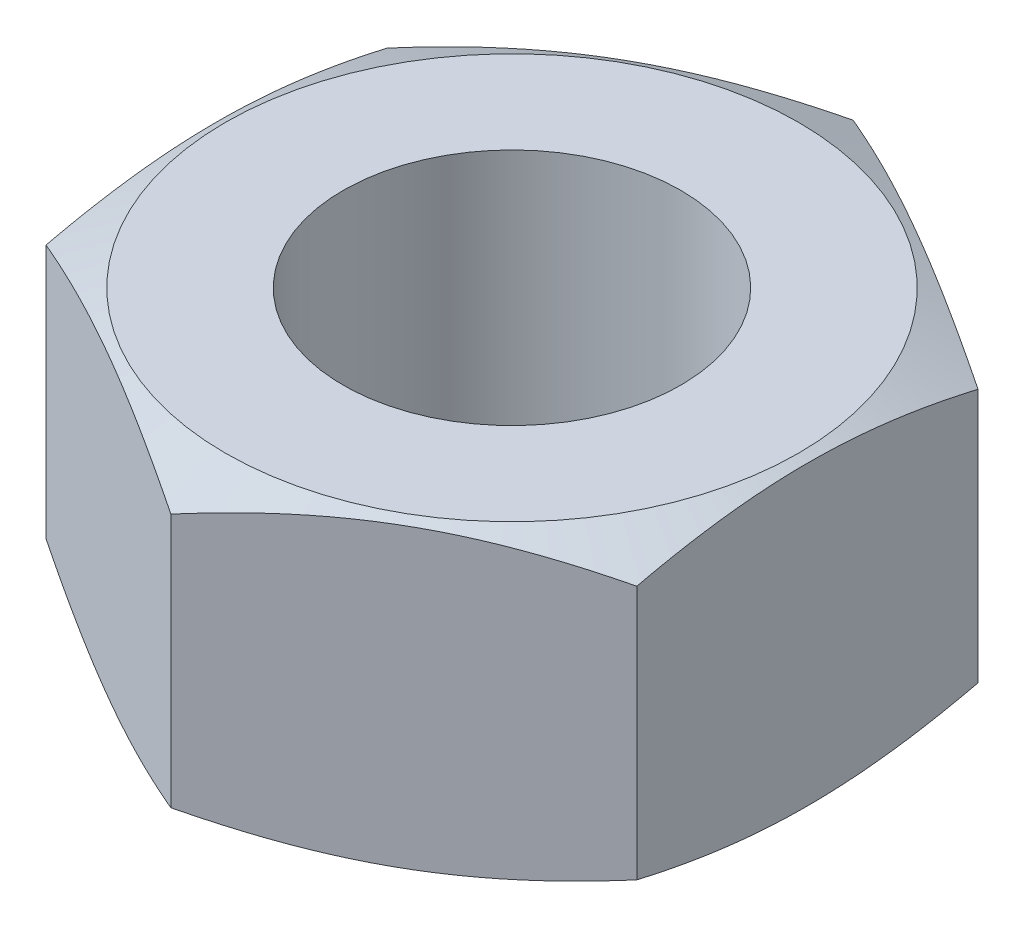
from build123d import *

# Parameters (mm, degrees)
SKETCH2_W          = 14.114770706
SKETCH2_H          = 14.114770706
CUT_EXTRUDE1_DEPTH = 5.7404


with BuildPart() as part:
    # Sketch1 → Base-Revolve (revolve)
    with BuildSketch(Plane.XY, mode=Mode.PRIVATE) as base_revolve_sk:
        Polygon((3.175, 0), (3.175, 5.7404), (5.389276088, 5.7404), (6.415804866, 5.261721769), (6.415804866, 0.478678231), (5.389276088, 0), align=None)
    revolve(base_revolve_sk.sketch.rotate(Axis((0, -57.404, 0), (0, 1, 0)), 90), axis=Axis((0, -57.404, 0), (0, 1, 0)))

    # Sketch2 → Cut-Extrude1 (cut)
    with BuildSketch(Plane(origin=(0, 0, 0), x_dir=(1, 0, 0), z_dir=(0, 1, 0))):
        Rectangle(SKETCH2_W, SKETCH2_H)
        Polygon((5.55625, 3.207902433), (0, 6.415804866), (-5.55625, 3.207902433), (-5.55625, -3.207902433), (0, -6.415804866), (5.55625, -3.207902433), align=None, mode=Mode.SUBTRACT)
    extrude(amount=CUT_EXTRUDE1_DEPTH, mode=Mode.SUBTRACT)


solid = part.part
